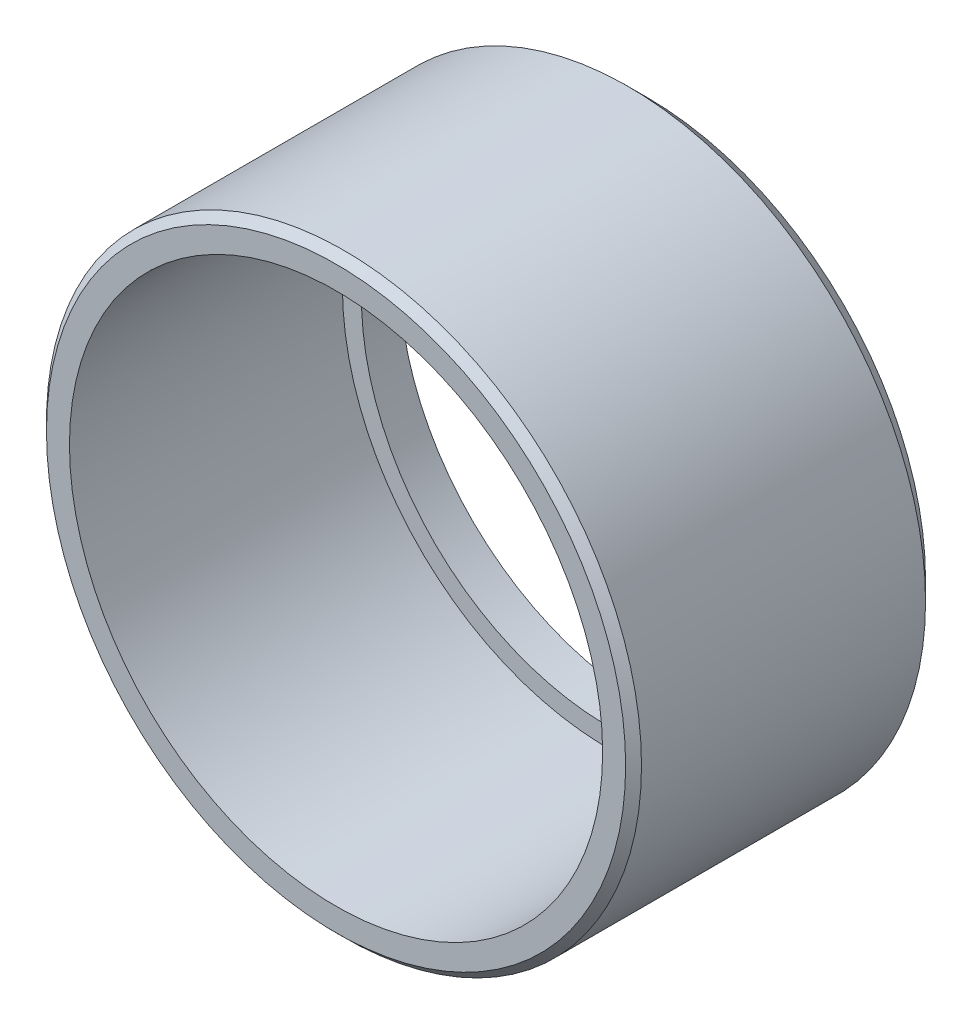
ISO-10303-21;
HEADER;
FILE_DESCRIPTION(('STEP AP214'),'2;1');
FILE_NAME('part.step','',(''),(''),'','','');
FILE_SCHEMA(('AUTOMOTIVE_DESIGN { 1 0 10303 214 1 1 1 1 }'));
ENDSEC;
DATA;
#1=APPLICATION_CONTEXT('core data for automotive mechanical design processes');
#2=APPLICATION_PROTOCOL_DEFINITION('international standard','automotive_design',2000,#1);
#3=PRODUCT_CONTEXT('',#1,'mechanical');
#4=PRODUCT('Part','Part','',(#3));
#5=PRODUCT_RELATED_PRODUCT_CATEGORY('part','',(#4));
#6=PRODUCT_DEFINITION_FORMATION('','',#4);
#7=PRODUCT_DEFINITION_CONTEXT('part definition',#1,'design');
#8=PRODUCT_DEFINITION('design','',#6,#7);
#9=PRODUCT_DEFINITION_SHAPE('','',#8);
#10=(LENGTH_UNIT() NAMED_UNIT(*) SI_UNIT(.MILLI.,.METRE.));
#11=(NAMED_UNIT(*) PLANE_ANGLE_UNIT() SI_UNIT($,.RADIAN.));
#12=(NAMED_UNIT(*) SI_UNIT($,.STERADIAN.) SOLID_ANGLE_UNIT());
#13=UNCERTAINTY_MEASURE_WITH_UNIT(LENGTH_MEASURE(1.E-05),#10,'distance_accuracy_value','');
#14=(GEOMETRIC_REPRESENTATION_CONTEXT(3) GLOBAL_UNCERTAINTY_ASSIGNED_CONTEXT((#13)) GLOBAL_UNIT_ASSIGNED_CONTEXT((#10,
#11,#12)) REPRESENTATION_CONTEXT('',''));
#15=CARTESIAN_POINT('',(0.,0.,0.));
#16=DIRECTION('',(0.,0.,1.));
#17=DIRECTION('',(1.,0.,0.));
#18=AXIS2_PLACEMENT_3D('',#15,#16,#17);
#19=CARTESIAN_POINT('',(0.,0.,49.784));
#20=DIRECTION('',(0.,0.,-1.));
#21=DIRECTION('',(-1.,0.,0.));
#22=AXIS2_PLACEMENT_3D('',#19,#20,#21);
#23=CYLINDRICAL_SURFACE('',#22,39.624);
#24=CARTESIAN_POINT('',(0.,0.,0.));
#25=DIRECTION('',(0.,0.,1.));
#26=DIRECTION('',(1.,0.,0.));
#27=AXIS2_PLACEMENT_3D('',#24,#25,#26);
#28=CIRCLE('',#27,39.624);
#29=CARTESIAN_POINT('',(39.624,0.,0.));
#30=VERTEX_POINT('',#29);
#31=EDGE_CURVE('E57',#30,#30,#28,.T.);
#32=ORIENTED_EDGE('',*,*,#31,.F.);
#33=EDGE_LOOP('',(#32));
#34=FACE_BOUND('',#33,.T.);
#35=CARTESIAN_POINT('',(0.,0.,6.096));
#36=DIRECTION('',(0.,0.,1.));
#37=DIRECTION('',(1.,0.,0.));
#38=AXIS2_PLACEMENT_3D('',#35,#36,#37);
#39=CIRCLE('',#38,39.624);
#40=CARTESIAN_POINT('',(39.624,0.,6.096));
#41=VERTEX_POINT('',#40);
#42=EDGE_CURVE('E58',#41,#41,#39,.T.);
#43=ORIENTED_EDGE('',*,*,#42,.T.);
#44=EDGE_LOOP('',(#43));
#45=FACE_BOUND('',#44,.T.);
#46=ADVANCED_FACE('F37',(#34,#45),#23,.F.);
#47=CARTESIAN_POINT('',(0.,0.,49.784));
#48=DIRECTION('',(0.,0.,1.));
#49=DIRECTION('',(1.,0.,0.));
#50=AXIS2_PLACEMENT_3D('',#47,#48,#49);
#51=PLANE('',#50);
#52=CARTESIAN_POINT('',(0.,0.,49.784));
#53=DIRECTION('',(0.,0.,1.));
#54=DIRECTION('',(1.,0.,0.));
#55=AXIS2_PLACEMENT_3D('',#52,#53,#54);
#56=CIRCLE('',#55,46.355);
#57=CARTESIAN_POINT('',(46.355,0.,49.784));
#58=VERTEX_POINT('',#57);
#59=EDGE_CURVE('E44',#58,#58,#56,.T.);
#60=ORIENTED_EDGE('',*,*,#59,.T.);
#61=EDGE_LOOP('',(#60));
#62=FACE_BOUND('',#61,.T.);
#63=CARTESIAN_POINT('',(0.,0.,49.784));
#64=DIRECTION('',(0.,0.,1.));
#65=DIRECTION('',(1.,0.,0.));
#66=AXIS2_PLACEMENT_3D('',#63,#64,#65);
#67=CIRCLE('',#66,42.672);
#68=CARTESIAN_POINT('',(42.672,0.,49.784));
#69=VERTEX_POINT('',#68);
#70=EDGE_CURVE('E64',#69,#69,#67,.T.);
#71=ORIENTED_EDGE('',*,*,#70,.F.);
#72=EDGE_LOOP('',(#71));
#73=FACE_BOUND('',#72,.T.);
#74=ADVANCED_FACE('F79',(#62,#73),#51,.T.);
#75=CARTESIAN_POINT('',(0.,0.,0.));
#76=DIRECTION('',(0.,0.,1.));
#77=DIRECTION('',(1.,0.,0.));
#78=AXIS2_PLACEMENT_3D('',#75,#76,#77);
#79=PLANE('',#78);
#80=CARTESIAN_POINT('',(0.,0.,0.));
#81=DIRECTION('',(0.,0.,1.));
#82=DIRECTION('',(1.,0.,0.));
#83=AXIS2_PLACEMENT_3D('',#80,#81,#82);
#84=CIRCLE('',#83,44.577);
#85=CARTESIAN_POINT('',(44.577,0.,0.));
#86=VERTEX_POINT('',#85);
#87=EDGE_CURVE('E48',#86,#86,#84,.F.);
#88=ORIENTED_EDGE('',*,*,#87,.T.);
#89=EDGE_LOOP('',(#88));
#90=FACE_BOUND('',#89,.T.);
#91=ORIENTED_EDGE('',*,*,#31,.T.);
#92=EDGE_LOOP('',(#91));
#93=FACE_BOUND('',#92,.T.);
#94=ADVANCED_FACE('F81',(#90,#93),#79,.F.);
#95=CARTESIAN_POINT('',(0.,0.,49.784));
#96=DIRECTION('',(0.,0.,-1.));
#97=DIRECTION('',(-1.,0.,0.));
#98=AXIS2_PLACEMENT_3D('',#95,#96,#97);
#99=CYLINDRICAL_SURFACE('',#98,47.625);
#100=CARTESIAN_POINT('',(0.,0.,48.514));
#101=DIRECTION('',(0.,0.,1.));
#102=DIRECTION('',(1.,0.,0.));
#103=AXIS2_PLACEMENT_3D('',#100,#101,#102);
#104=CIRCLE('',#103,47.625);
#105=CARTESIAN_POINT('',(47.625,0.,48.514));
#106=VERTEX_POINT('',#105);
#107=EDGE_CURVE('E10',#106,#106,#104,.F.);
#108=ORIENTED_EDGE('',*,*,#107,.T.);
#109=EDGE_LOOP('',(#108));
#110=FACE_BOUND('',#109,.T.);
#111=CARTESIAN_POINT('',(0.,0.,3.04800000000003));
#112=DIRECTION('',(0.,0.,1.));
#113=DIRECTION('',(1.,0.,0.));
#114=AXIS2_PLACEMENT_3D('',#111,#112,#113);
#115=CIRCLE('',#114,47.625);
#116=CARTESIAN_POINT('',(47.625,0.,3.04800000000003));
#117=VERTEX_POINT('',#116);
#118=EDGE_CURVE('E52',#117,#117,#115,.T.);
#119=ORIENTED_EDGE('',*,*,#118,.T.);
#120=EDGE_LOOP('',(#119));
#121=FACE_BOUND('',#120,.T.);
#122=ADVANCED_FACE('F75',(#110,#121),#99,.T.);
#123=CARTESIAN_POINT('',(0.,0.,6.096));
#124=DIRECTION('',(0.,0.,1.));
#125=DIRECTION('',(1.,0.,0.));
#126=AXIS2_PLACEMENT_3D('',#123,#124,#125);
#127=CYLINDRICAL_SURFACE('',#126,42.672);
#128=CARTESIAN_POINT('',(0.,0.,6.096));
#129=DIRECTION('',(0.,0.,1.));
#130=DIRECTION('',(1.,0.,0.));
#131=AXIS2_PLACEMENT_3D('',#128,#129,#130);
#132=CIRCLE('',#131,42.672);
#133=CARTESIAN_POINT('',(42.672,0.,6.096));
#134=VERTEX_POINT('',#133);
#135=EDGE_CURVE('E61',#134,#134,#132,.T.);
#136=ORIENTED_EDGE('',*,*,#135,.F.);
#137=EDGE_LOOP('',(#136));
#138=FACE_BOUND('',#137,.T.);
#139=ORIENTED_EDGE('',*,*,#70,.T.);
#140=EDGE_LOOP('',(#139));
#141=FACE_BOUND('',#140,.T.);
#142=ADVANCED_FACE('F72',(#138,#141),#127,.F.);
#143=CARTESIAN_POINT('',(0.,0.,6.096));
#144=DIRECTION('',(0.,0.,1.));
#145=DIRECTION('',(1.,0.,0.));
#146=AXIS2_PLACEMENT_3D('',#143,#144,#145);
#147=PLANE('',#146);
#148=ORIENTED_EDGE('',*,*,#42,.F.);
#149=EDGE_LOOP('',(#148));
#150=FACE_BOUND('',#149,.T.);
#151=ORIENTED_EDGE('',*,*,#135,.T.);
#152=EDGE_LOOP('',(#151));
#153=FACE_BOUND('',#152,.T.);
#154=ADVANCED_FACE('F70',(#150,#153),#147,.T.);
#155=CARTESIAN_POINT('',(0.,0.,3.04800000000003));
#156=DIRECTION('',(0.,0.,1.));
#157=DIRECTION('',(1.,0.,0.));
#158=AXIS2_PLACEMENT_3D('',#155,#156,#157);
#159=CONICAL_SURFACE('',#158,47.625,0.785398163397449);
#160=ORIENTED_EDGE('',*,*,#87,.F.);
#161=EDGE_LOOP('',(#160));
#162=FACE_BOUND('',#161,.T.);
#163=ORIENTED_EDGE('',*,*,#118,.F.);
#164=EDGE_LOOP('',(#163));
#165=FACE_BOUND('',#164,.T.);
#166=ADVANCED_FACE('F94',(#162,#165),#159,.T.);
#167=CARTESIAN_POINT('',(0.,0.,49.784));
#168=DIRECTION('',(0.,0.,-1.));
#169=DIRECTION('',(-1.,0.,0.));
#170=AXIS2_PLACEMENT_3D('',#167,#168,#169);
#171=CONICAL_SURFACE('',#170,46.355,0.785398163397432);
#172=ORIENTED_EDGE('',*,*,#107,.F.);
#173=EDGE_LOOP('',(#172));
#174=FACE_BOUND('',#173,.T.);
#175=ORIENTED_EDGE('',*,*,#59,.F.);
#176=EDGE_LOOP('',(#175));
#177=FACE_BOUND('',#176,.T.);
#178=ADVANCED_FACE('F39',(#174,#177),#171,.T.);
#179=CLOSED_SHELL('',(#46,#74,#94,#122,#142,#154,#166,#178));
#180=MANIFOLD_SOLID_BREP('B2',#179);
#181=ADVANCED_BREP_SHAPE_REPRESENTATION('',(#18,#180),#14);
#182=SHAPE_DEFINITION_REPRESENTATION(#9,#181);
ENDSEC;
END-ISO-10303-21;
